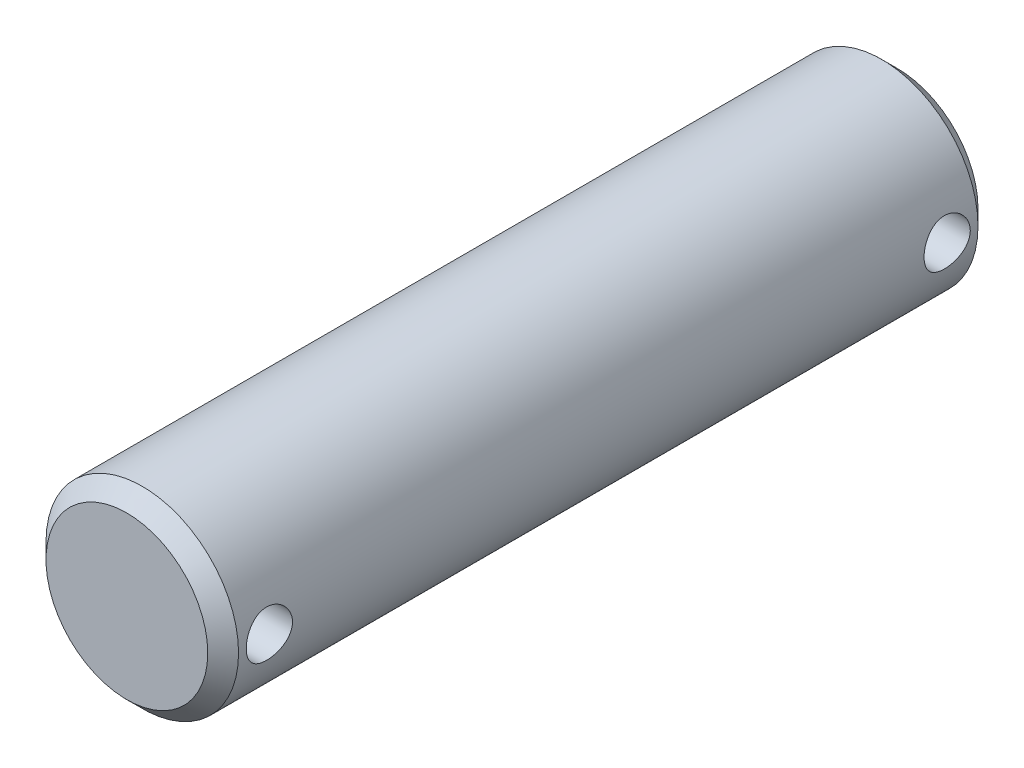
from build123d import *

# Parameters (mm, degrees)
ESQUISSE1_R             = 12.5
BASE_EXTRUSION_DEPTH    = 100
CHANFREIN1_SIZE         = 2
ESQUISSE2_R             = 3
ENL_V_MAT_EXTRU_1_DEPTH = 14


with BuildPart() as part:
    # Esquisse1 → Base-Extrusion (new body)
    with BuildSketch(Plane.XY):
        Circle(ESQUISSE1_R)
    extrude(amount=BASE_EXTRUSION_DEPTH)

    # Chanfrein1
    chanfrein1_edges = [part.edges().sort_by_distance(p)[0] for p in [
        (-12.5, 0, 0),
        (-12.5, 0, 100),
    ]]
    chamfer(chanfrein1_edges, length=CHANFREIN1_SIZE)

    # Esquisse2 → Enl_v. mat.-Extru.1 (cut, symmetric)
    with BuildSketch(Plane(origin=(0, 0, 0), x_dir=(0, 0, -1), z_dir=(1, 0, 0))):
        with Locations(Location((-6, 0, 0), (0, 0, 180))):
            Circle(ESQUISSE2_R)
        with Locations(Location((-94, 0, 0), (0, 0, 180))):
            Circle(ESQUISSE2_R)
    extrude(amount=ENL_V_MAT_EXTRU_1_DEPTH, both=True, mode=Mode.SUBTRACT)


solid = part.part
